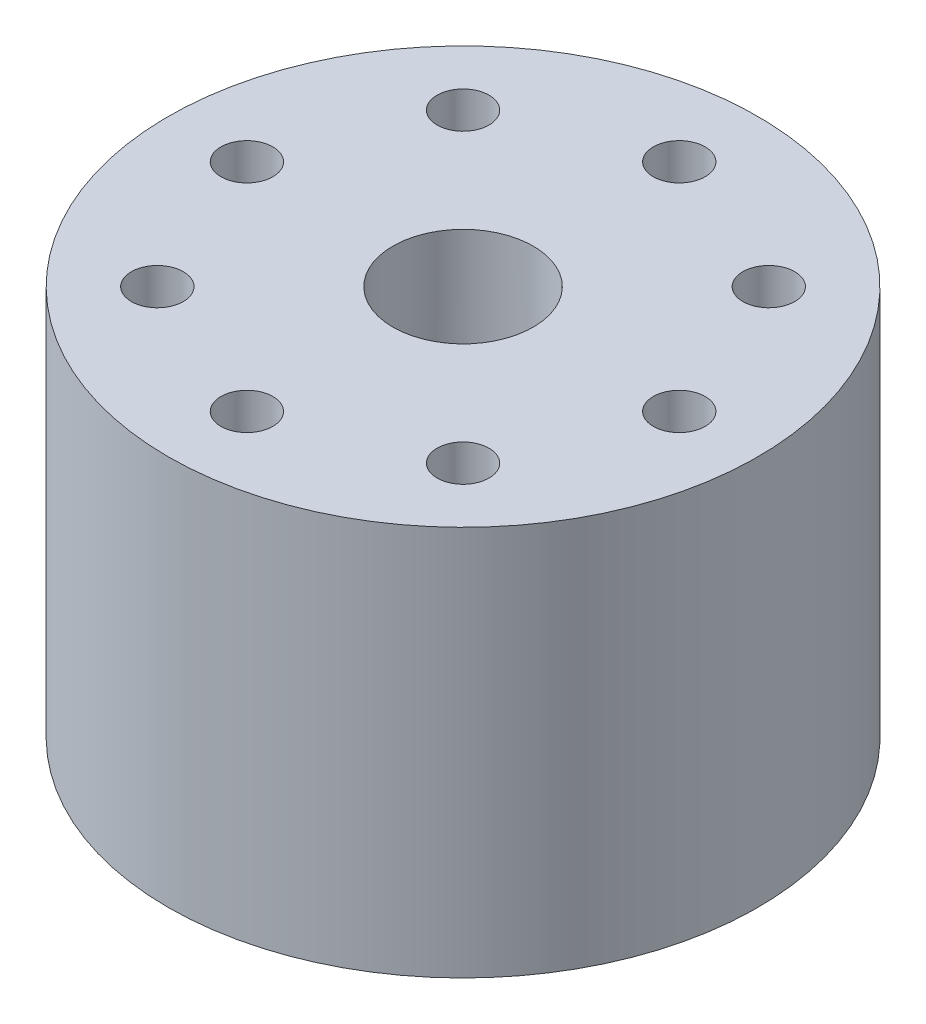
ISO-10303-21;
HEADER;
FILE_DESCRIPTION(('STEP AP214'),'2;1');
FILE_NAME('part.step','',(''),(''),'','','');
FILE_SCHEMA(('AUTOMOTIVE_DESIGN { 1 0 10303 214 1 1 1 1 }'));
ENDSEC;
DATA;
#1=APPLICATION_CONTEXT('core data for automotive mechanical design processes');
#2=APPLICATION_PROTOCOL_DEFINITION('international standard','automotive_design',2000,#1);
#3=PRODUCT_CONTEXT('',#1,'mechanical');
#4=PRODUCT('Part','Part','',(#3));
#5=PRODUCT_RELATED_PRODUCT_CATEGORY('part','',(#4));
#6=PRODUCT_DEFINITION_FORMATION('','',#4);
#7=PRODUCT_DEFINITION_CONTEXT('part definition',#1,'design');
#8=PRODUCT_DEFINITION('design','',#6,#7);
#9=PRODUCT_DEFINITION_SHAPE('','',#8);
#10=(LENGTH_UNIT() NAMED_UNIT(*) SI_UNIT(.MILLI.,.METRE.));
#11=(NAMED_UNIT(*) PLANE_ANGLE_UNIT() SI_UNIT($,.RADIAN.));
#12=(NAMED_UNIT(*) SI_UNIT($,.STERADIAN.) SOLID_ANGLE_UNIT());
#13=UNCERTAINTY_MEASURE_WITH_UNIT(LENGTH_MEASURE(1.E-05),#10,'distance_accuracy_value','');
#14=(GEOMETRIC_REPRESENTATION_CONTEXT(3) GLOBAL_UNCERTAINTY_ASSIGNED_CONTEXT((#13)) GLOBAL_UNIT_ASSIGNED_CONTEXT((#10,
#11,#12)) REPRESENTATION_CONTEXT('',''));
#15=CARTESIAN_POINT('',(0.,0.,0.));
#16=DIRECTION('',(0.,0.,1.));
#17=DIRECTION('',(1.,0.,0.));
#18=AXIS2_PLACEMENT_3D('',#15,#16,#17);
#19=CARTESIAN_POINT('',(0.,49.65,0.));
#20=DIRECTION('',(0.,-1.,0.));
#21=DIRECTION('',(0.,0.,-1.));
#22=AXIS2_PLACEMENT_3D('',#19,#20,#21);
#23=CYLINDRICAL_SURFACE('',#22,37.5);
#24=CARTESIAN_POINT('',(0.,49.65,0.));
#25=DIRECTION('',(0.,1.,0.));
#26=DIRECTION('',(0.,0.,1.));
#27=AXIS2_PLACEMENT_3D('',#24,#25,#26);
#28=CIRCLE('',#27,37.5);
#29=CARTESIAN_POINT('',(0.,49.65,37.5));
#30=VERTEX_POINT('',#29);
#31=EDGE_CURVE('E54',#30,#30,#28,.T.);
#32=ORIENTED_EDGE('',*,*,#31,.F.);
#33=EDGE_LOOP('',(#32));
#34=FACE_BOUND('',#33,.T.);
#35=CARTESIAN_POINT('',(0.,0.,0.));
#36=DIRECTION('',(0.,1.,0.));
#37=DIRECTION('',(0.,0.,1.));
#38=AXIS2_PLACEMENT_3D('',#35,#36,#37);
#39=CIRCLE('',#38,37.5);
#40=CARTESIAN_POINT('',(0.,0.,37.5));
#41=VERTEX_POINT('',#40);
#42=EDGE_CURVE('E58',#41,#41,#39,.T.);
#43=ORIENTED_EDGE('',*,*,#42,.T.);
#44=EDGE_LOOP('',(#43));
#45=FACE_BOUND('',#44,.T.);
#46=ADVANCED_FACE('F43',(#34,#45),#23,.T.);
#47=CARTESIAN_POINT('',(0.,49.65,0.));
#48=DIRECTION('',(0.,1.,0.));
#49=DIRECTION('',(0.,0.,1.));
#50=AXIS2_PLACEMENT_3D('',#47,#48,#49);
#51=PLANE('',#50);
#52=CARTESIAN_POINT('',(0.,49.65,27.5));
#53=DIRECTION('',(0.,1.,0.));
#54=DIRECTION('',(0.,0.,1.));
#55=AXIS2_PLACEMENT_3D('',#52,#53,#54);
#56=CIRCLE('',#55,3.3);
#57=CARTESIAN_POINT('',(0.,49.65,30.8));
#58=VERTEX_POINT('',#57);
#59=EDGE_CURVE('E273',#58,#58,#56,.T.);
#60=ORIENTED_EDGE('',*,*,#59,.F.);
#61=EDGE_LOOP('',(#60));
#62=FACE_BOUND('',#61,.T.);
#63=CARTESIAN_POINT('',(-19.4454364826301,49.65,19.44543648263));
#64=DIRECTION('',(0.,1.,0.));
#65=DIRECTION('',(0.,0.,1.));
#66=AXIS2_PLACEMENT_3D('',#63,#64,#65);
#67=CIRCLE('',#66,3.3);
#68=CARTESIAN_POINT('',(-19.4454364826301,49.65,22.74543648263));
#69=VERTEX_POINT('',#68);
#70=EDGE_CURVE('E279',#69,#69,#67,.T.);
#71=ORIENTED_EDGE('',*,*,#70,.F.);
#72=EDGE_LOOP('',(#71));
#73=FACE_BOUND('',#72,.T.);
#74=CARTESIAN_POINT('',(-27.5,49.65,0.));
#75=DIRECTION('',(0.,1.,0.));
#76=DIRECTION('',(0.,0.,1.));
#77=AXIS2_PLACEMENT_3D('',#74,#75,#76);
#78=CIRCLE('',#77,3.3);
#79=CARTESIAN_POINT('',(-27.5,49.65,3.2999999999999));
#80=VERTEX_POINT('',#79);
#81=EDGE_CURVE('E290',#80,#80,#78,.T.);
#82=ORIENTED_EDGE('',*,*,#81,.F.);
#83=EDGE_LOOP('',(#82));
#84=FACE_BOUND('',#83,.T.);
#85=CARTESIAN_POINT('',(-19.44543648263,49.65,-19.4454364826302));
#86=DIRECTION('',(0.,1.,0.));
#87=DIRECTION('',(0.,0.,1.));
#88=AXIS2_PLACEMENT_3D('',#85,#86,#87);
#89=CIRCLE('',#88,3.3);
#90=CARTESIAN_POINT('',(-19.44543648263,49.65,-16.1454364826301));
#91=VERTEX_POINT('',#90);
#92=EDGE_CURVE('E296',#91,#91,#89,.T.);
#93=ORIENTED_EDGE('',*,*,#92,.F.);
#94=EDGE_LOOP('',(#93));
#95=FACE_BOUND('',#94,.T.);
#96=CARTESIAN_POINT('',(1.92031473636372E-13,49.65,-27.5));
#97=DIRECTION('',(0.,1.,0.));
#98=DIRECTION('',(0.,0.,1.));
#99=AXIS2_PLACEMENT_3D('',#96,#97,#98);
#100=CIRCLE('',#99,3.3);
#101=CARTESIAN_POINT('',(1.92031473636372E-13,49.65,-24.2));
#102=VERTEX_POINT('',#101);
#103=EDGE_CURVE('E302',#102,#102,#100,.T.);
#104=ORIENTED_EDGE('',*,*,#103,.F.);
#105=EDGE_LOOP('',(#104));
#106=FACE_BOUND('',#105,.T.);
#107=CARTESIAN_POINT('',(19.4454364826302,49.65,-19.4454364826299));
#108=DIRECTION('',(0.,1.,0.));
#109=DIRECTION('',(0.,0.,1.));
#110=AXIS2_PLACEMENT_3D('',#107,#108,#109);
#111=CIRCLE('',#110,3.3);
#112=CARTESIAN_POINT('',(19.4454364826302,49.65,-16.1454364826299));
#113=VERTEX_POINT('',#112);
#114=EDGE_CURVE('E331',#113,#113,#111,.T.);
#115=ORIENTED_EDGE('',*,*,#114,.F.);
#116=EDGE_LOOP('',(#115));
#117=FACE_BOUND('',#116,.T.);
#118=CARTESIAN_POINT('',(27.5,49.65,2.88047210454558E-13));
#119=DIRECTION('',(0.,1.,0.));
#120=DIRECTION('',(0.,0.,1.));
#121=AXIS2_PLACEMENT_3D('',#118,#119,#120);
#122=CIRCLE('',#121,3.3);
#123=CARTESIAN_POINT('',(27.5,49.65,3.30000000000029));
#124=VERTEX_POINT('',#123);
#125=EDGE_CURVE('E338',#124,#124,#122,.T.);
#126=ORIENTED_EDGE('',*,*,#125,.F.);
#127=EDGE_LOOP('',(#126));
#128=FACE_BOUND('',#127,.T.);
#129=CARTESIAN_POINT('',(19.4454364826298,49.65,19.4454364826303));
#130=DIRECTION('',(0.,1.,0.));
#131=DIRECTION('',(0.,0.,1.));
#132=AXIS2_PLACEMENT_3D('',#129,#130,#131);
#133=CIRCLE('',#132,3.3);
#134=CARTESIAN_POINT('',(19.4454364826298,49.65,22.7454364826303));
#135=VERTEX_POINT('',#134);
#136=EDGE_CURVE('E274',#135,#135,#133,.T.);
#137=ORIENTED_EDGE('',*,*,#136,.F.);
#138=EDGE_LOOP('',(#137));
#139=FACE_BOUND('',#138,.T.);
#140=CARTESIAN_POINT('',(0.,49.65,0.));
#141=DIRECTION('',(0.,1.,0.));
#142=DIRECTION('',(0.,0.,1.));
#143=AXIS2_PLACEMENT_3D('',#140,#141,#142);
#144=CIRCLE('',#143,8.93);
#145=CARTESIAN_POINT('',(0.,49.65,8.93));
#146=VERTEX_POINT('',#145);
#147=EDGE_CURVE('E62',#146,#146,#144,.T.);
#148=ORIENTED_EDGE('',*,*,#147,.F.);
#149=EDGE_LOOP('',(#148));
#150=FACE_BOUND('',#149,.T.);
#151=ORIENTED_EDGE('',*,*,#31,.T.);
#152=EDGE_LOOP('',(#151));
#153=FACE_BOUND('',#152,.T.);
#154=ADVANCED_FACE('F104',(#62,#73,#84,#95,#106,#117,#128,#139,#150,#153),#51,.T.);
#155=CARTESIAN_POINT('',(0.,0.,0.));
#156=DIRECTION('',(0.,1.,0.));
#157=DIRECTION('',(0.,0.,1.));
#158=AXIS2_PLACEMENT_3D('',#155,#156,#157);
#159=PLANE('',#158);
#160=CARTESIAN_POINT('',(0.,0.,27.5));
#161=DIRECTION('',(0.,1.,0.));
#162=DIRECTION('',(0.,0.,1.));
#163=AXIS2_PLACEMENT_3D('',#160,#161,#162);
#164=CIRCLE('',#163,3.3);
#165=CARTESIAN_POINT('',(0.,0.,30.8));
#166=VERTEX_POINT('',#165);
#167=EDGE_CURVE('E270',#166,#166,#164,.T.);
#168=ORIENTED_EDGE('',*,*,#167,.T.);
#169=EDGE_LOOP('',(#168));
#170=FACE_BOUND('',#169,.T.);
#171=CARTESIAN_POINT('',(-19.4454364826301,0.,19.44543648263));
#172=DIRECTION('',(0.,1.,0.));
#173=DIRECTION('',(0.,0.,1.));
#174=AXIS2_PLACEMENT_3D('',#171,#172,#173);
#175=CIRCLE('',#174,3.3);
#176=CARTESIAN_POINT('',(-19.4454364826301,0.,22.74543648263));
#177=VERTEX_POINT('',#176);
#178=EDGE_CURVE('E287',#177,#177,#175,.T.);
#179=ORIENTED_EDGE('',*,*,#178,.T.);
#180=EDGE_LOOP('',(#179));
#181=FACE_BOUND('',#180,.T.);
#182=CARTESIAN_POINT('',(-27.5,0.,0.));
#183=DIRECTION('',(0.,1.,0.));
#184=DIRECTION('',(0.,0.,1.));
#185=AXIS2_PLACEMENT_3D('',#182,#183,#184);
#186=CIRCLE('',#185,3.3);
#187=CARTESIAN_POINT('',(-27.5,0.,3.2999999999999));
#188=VERTEX_POINT('',#187);
#189=EDGE_CURVE('E293',#188,#188,#186,.T.);
#190=ORIENTED_EDGE('',*,*,#189,.T.);
#191=EDGE_LOOP('',(#190));
#192=FACE_BOUND('',#191,.T.);
#193=CARTESIAN_POINT('',(-19.44543648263,0.,-19.4454364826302));
#194=DIRECTION('',(0.,1.,0.));
#195=DIRECTION('',(0.,0.,1.));
#196=AXIS2_PLACEMENT_3D('',#193,#194,#195);
#197=CIRCLE('',#196,3.3);
#198=CARTESIAN_POINT('',(-19.44543648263,0.,-16.1454364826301));
#199=VERTEX_POINT('',#198);
#200=EDGE_CURVE('E299',#199,#199,#197,.T.);
#201=ORIENTED_EDGE('',*,*,#200,.T.);
#202=EDGE_LOOP('',(#201));
#203=FACE_BOUND('',#202,.T.);
#204=CARTESIAN_POINT('',(1.92031473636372E-13,0.,-27.5));
#205=DIRECTION('',(0.,1.,0.));
#206=DIRECTION('',(0.,0.,1.));
#207=AXIS2_PLACEMENT_3D('',#204,#205,#206);
#208=CIRCLE('',#207,3.3);
#209=CARTESIAN_POINT('',(1.92031473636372E-13,0.,-24.2));
#210=VERTEX_POINT('',#209);
#211=EDGE_CURVE('E326',#210,#210,#208,.T.);
#212=ORIENTED_EDGE('',*,*,#211,.T.);
#213=EDGE_LOOP('',(#212));
#214=FACE_BOUND('',#213,.T.);
#215=CARTESIAN_POINT('',(19.4454364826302,0.,-19.4454364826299));
#216=DIRECTION('',(0.,1.,0.));
#217=DIRECTION('',(0.,0.,1.));
#218=AXIS2_PLACEMENT_3D('',#215,#216,#217);
#219=CIRCLE('',#218,3.3);
#220=CARTESIAN_POINT('',(19.4454364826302,0.,-16.1454364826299));
#221=VERTEX_POINT('',#220);
#222=EDGE_CURVE('E336',#221,#221,#219,.T.);
#223=ORIENTED_EDGE('',*,*,#222,.T.);
#224=EDGE_LOOP('',(#223));
#225=FACE_BOUND('',#224,.T.);
#226=CARTESIAN_POINT('',(27.5,0.,2.88047210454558E-13));
#227=DIRECTION('',(0.,1.,0.));
#228=DIRECTION('',(0.,0.,1.));
#229=AXIS2_PLACEMENT_3D('',#226,#227,#228);
#230=CIRCLE('',#229,3.3);
#231=CARTESIAN_POINT('',(27.5,0.,3.30000000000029));
#232=VERTEX_POINT('',#231);
#233=EDGE_CURVE('E282',#232,#232,#230,.T.);
#234=ORIENTED_EDGE('',*,*,#233,.T.);
#235=EDGE_LOOP('',(#234));
#236=FACE_BOUND('',#235,.T.);
#237=CARTESIAN_POINT('',(19.4454364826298,0.,19.4454364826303));
#238=DIRECTION('',(0.,1.,0.));
#239=DIRECTION('',(0.,0.,1.));
#240=AXIS2_PLACEMENT_3D('',#237,#238,#239);
#241=CIRCLE('',#240,3.3);
#242=CARTESIAN_POINT('',(19.4454364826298,0.,22.7454364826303));
#243=VERTEX_POINT('',#242);
#244=EDGE_CURVE('E277',#243,#243,#241,.T.);
#245=ORIENTED_EDGE('',*,*,#244,.T.);
#246=EDGE_LOOP('',(#245));
#247=FACE_BOUND('',#246,.T.);
#248=CARTESIAN_POINT('',(0.,0.,0.));
#249=DIRECTION('',(0.,-1.,0.));
#250=DIRECTION('',(0.,0.,-1.));
#251=AXIS2_PLACEMENT_3D('',#248,#249,#250);
#252=CIRCLE('',#251,17.);
#253=CARTESIAN_POINT('',(0.,0.,-17.));
#254=VERTEX_POINT('',#253);
#255=EDGE_CURVE('E67',#254,#254,#252,.T.);
#256=ORIENTED_EDGE('',*,*,#255,.F.);
#257=EDGE_LOOP('',(#256));
#258=FACE_BOUND('',#257,.T.);
#259=ORIENTED_EDGE('',*,*,#42,.F.);
#260=EDGE_LOOP('',(#259));
#261=FACE_BOUND('',#260,.T.);
#262=ADVANCED_FACE('F103',(#170,#181,#192,#203,#214,#225,#236,#247,#258,#261),#159,.F.);
#263=CARTESIAN_POINT('',(0.,26.65,0.));
#264=DIRECTION('',(0.,1.,0.));
#265=DIRECTION('',(0.,0.,1.));
#266=AXIS2_PLACEMENT_3D('',#263,#264,#265);
#267=CYLINDRICAL_SURFACE('',#266,8.93);
#268=CARTESIAN_POINT('',(0.,31.4170143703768,0.));
#269=DIRECTION('',(0.,1.,0.));
#270=DIRECTION('',(0.,0.,1.));
#271=AXIS2_PLACEMENT_3D('',#268,#269,#270);
#272=CIRCLE('',#271,8.93);
#273=CARTESIAN_POINT('',(0.,31.4170143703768,8.93));
#274=VERTEX_POINT('',#273);
#275=EDGE_CURVE('E11',#274,#274,#272,.F.);
#276=ORIENTED_EDGE('',*,*,#275,.T.);
#277=EDGE_LOOP('',(#276));
#278=FACE_BOUND('',#277,.T.);
#279=ORIENTED_EDGE('',*,*,#147,.T.);
#280=EDGE_LOOP('',(#279));
#281=FACE_BOUND('',#280,.T.);
#282=ADVANCED_FACE('F96',(#278,#281),#267,.F.);
#283=CARTESIAN_POINT('',(0.,3.15,0.));
#284=DIRECTION('',(0.,-1.,0.));
#285=DIRECTION('',(0.,0.,-1.));
#286=AXIS2_PLACEMENT_3D('',#283,#284,#285);
#287=PLANE('',#286);
#288=CARTESIAN_POINT('',(0.,3.15,0.));
#289=DIRECTION('',(0.,-1.,0.));
#290=DIRECTION('',(0.,0.,-1.));
#291=AXIS2_PLACEMENT_3D('',#288,#289,#290);
#292=CIRCLE('',#291,17.);
#293=CARTESIAN_POINT('',(0.,3.15,-17.));
#294=VERTEX_POINT('',#293);
#295=EDGE_CURVE('E66',#294,#294,#292,.T.);
#296=ORIENTED_EDGE('',*,*,#295,.T.);
#297=EDGE_LOOP('',(#296));
#298=FACE_BOUND('',#297,.T.);
#299=CARTESIAN_POINT('',(0.,3.15,0.));
#300=DIRECTION('',(0.,-1.,0.));
#301=DIRECTION('',(0.,0.,-1.));
#302=AXIS2_PLACEMENT_3D('',#299,#300,#301);
#303=CIRCLE('',#302,13.);
#304=CARTESIAN_POINT('',(0.,3.15,-13.));
#305=VERTEX_POINT('',#304);
#306=EDGE_CURVE('E70',#305,#305,#303,.T.);
#307=ORIENTED_EDGE('',*,*,#306,.F.);
#308=EDGE_LOOP('',(#307));
#309=FACE_BOUND('',#308,.T.);
#310=ADVANCED_FACE('F93',(#298,#309),#287,.T.);
#311=CARTESIAN_POINT('',(0.,3.15,0.));
#312=DIRECTION('',(0.,-1.,0.));
#313=DIRECTION('',(0.,0.,-1.));
#314=AXIS2_PLACEMENT_3D('',#311,#312,#313);
#315=CYLINDRICAL_SURFACE('',#314,17.);
#316=ORIENTED_EDGE('',*,*,#295,.F.);
#317=EDGE_LOOP('',(#316));
#318=FACE_BOUND('',#317,.T.);
#319=ORIENTED_EDGE('',*,*,#255,.T.);
#320=EDGE_LOOP('',(#319));
#321=FACE_BOUND('',#320,.T.);
#322=ADVANCED_FACE('F90',(#318,#321),#315,.F.);
#323=CARTESIAN_POINT('',(-13.,21.61,0.));
#324=CARTESIAN_POINT('',(-20.8,12.38,0.));
#325=CARTESIAN_POINT('',(-13.,3.15,0.));
#326=B_SPLINE_CURVE_WITH_KNOTS('',2,(#323,#324,#325),.UNSPECIFIED.,.F.,.F.,(3,3),(0.,1.),.UNSPECIFIED.);
#327=CARTESIAN_POINT('',(0.,3.15,0.));
#328=DIRECTION('',(0.,-1.,0.));
#329=AXIS1_PLACEMENT('',#327,#328);
#330=SURFACE_OF_REVOLUTION('',#326,#329);
#331=ORIENTED_EDGE('',*,*,#306,.T.);
#332=EDGE_LOOP('',(#331));
#333=FACE_BOUND('',#332,.T.);
#334=CARTESIAN_POINT('',(0.,21.61,0.));
#335=DIRECTION('',(0.,1.,0.));
#336=DIRECTION('',(-1.,0.,0.));
#337=AXIS2_PLACEMENT_3D('',#334,#335,#336);
#338=CIRCLE('',#337,13.);
#339=CARTESIAN_POINT('',(-13.,21.61,0.));
#340=VERTEX_POINT('',#339);
#341=EDGE_CURVE('E75',#340,#340,#338,.T.);
#342=ORIENTED_EDGE('',*,*,#341,.T.);
#343=EDGE_LOOP('',(#342));
#344=FACE_BOUND('',#343,.T.);
#345=ADVANCED_FACE('F85',(#333,#344),#330,.F.);
#346=CARTESIAN_POINT('',(-13.,26.65,0.));
#347=DIRECTION('',(0.,1.,0.));
#348=DIRECTION('',(-1.,0.,0.));
#349=AXIS2_PLACEMENT_3D('',#346,#347,#348);
#350=PLANE('',#349);
#351=CARTESIAN_POINT('',(0.,26.65,0.));
#352=DIRECTION('',(0.,1.,0.));
#353=DIRECTION('',(-1.,0.,0.));
#354=AXIS2_PLACEMENT_3D('',#351,#352,#353);
#355=CIRCLE('',#354,12.93);
#356=CARTESIAN_POINT('',(-12.93,26.65,0.));
#357=VERTEX_POINT('',#356);
#358=EDGE_CURVE('E50',#357,#357,#355,.T.);
#359=ORIENTED_EDGE('',*,*,#358,.T.);
#360=EDGE_LOOP('',(#359));
#361=FACE_BOUND('',#360,.T.);
#362=CARTESIAN_POINT('',(0.,26.65,0.));
#363=DIRECTION('',(0.,1.,0.));
#364=DIRECTION('',(-1.,0.,0.));
#365=AXIS2_PLACEMENT_3D('',#362,#363,#364);
#366=CIRCLE('',#365,13.);
#367=CARTESIAN_POINT('',(-13.,26.65,0.));
#368=VERTEX_POINT('',#367);
#369=EDGE_CURVE('E304',#368,#368,#366,.T.);
#370=ORIENTED_EDGE('',*,*,#369,.F.);
#371=EDGE_LOOP('',(#370));
#372=FACE_BOUND('',#371,.T.);
#373=ADVANCED_FACE('F89',(#361,#372),#350,.F.);
#374=CARTESIAN_POINT('',(0.,26.65,0.));
#375=DIRECTION('',(0.,1.,0.));
#376=DIRECTION('',(-1.,0.,0.));
#377=AXIS2_PLACEMENT_3D('',#374,#375,#376);
#378=CYLINDRICAL_SURFACE('',#377,13.);
#379=ORIENTED_EDGE('',*,*,#341,.F.);
#380=EDGE_LOOP('',(#379));
#381=FACE_BOUND('',#380,.T.);
#382=ORIENTED_EDGE('',*,*,#369,.T.);
#383=EDGE_LOOP('',(#382));
#384=FACE_BOUND('',#383,.T.);
#385=ADVANCED_FACE('F152',(#381,#384),#378,.F.);
#386=CARTESIAN_POINT('',(19.4454364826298,0.,19.4454364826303));
#387=DIRECTION('',(0.,1.,0.));
#388=DIRECTION('',(0.,0.,1.));
#389=AXIS2_PLACEMENT_3D('',#386,#387,#388);
#390=CYLINDRICAL_SURFACE('',#389,3.3);
#391=ORIENTED_EDGE('',*,*,#244,.F.);
#392=EDGE_LOOP('',(#391));
#393=FACE_BOUND('',#392,.T.);
#394=ORIENTED_EDGE('',*,*,#136,.T.);
#395=EDGE_LOOP('',(#394));
#396=FACE_BOUND('',#395,.T.);
#397=ADVANCED_FACE('F158',(#393,#396),#390,.F.);
#398=CARTESIAN_POINT('',(27.5,0.,2.88047210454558E-13));
#399=DIRECTION('',(0.,1.,0.));
#400=DIRECTION('',(0.,0.,1.));
#401=AXIS2_PLACEMENT_3D('',#398,#399,#400);
#402=CYLINDRICAL_SURFACE('',#401,3.3);
#403=ORIENTED_EDGE('',*,*,#125,.T.);
#404=EDGE_LOOP('',(#403));
#405=FACE_BOUND('',#404,.T.);
#406=ORIENTED_EDGE('',*,*,#233,.F.);
#407=EDGE_LOOP('',(#406));
#408=FACE_BOUND('',#407,.T.);
#409=ADVANCED_FACE('F164',(#405,#408),#402,.F.);
#410=CARTESIAN_POINT('',(19.4454364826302,0.,-19.4454364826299));
#411=DIRECTION('',(0.,1.,0.));
#412=DIRECTION('',(0.,0.,1.));
#413=AXIS2_PLACEMENT_3D('',#410,#411,#412);
#414=CYLINDRICAL_SURFACE('',#413,3.3);
#415=ORIENTED_EDGE('',*,*,#222,.F.);
#416=EDGE_LOOP('',(#415));
#417=FACE_BOUND('',#416,.T.);
#418=ORIENTED_EDGE('',*,*,#114,.T.);
#419=EDGE_LOOP('',(#418));
#420=FACE_BOUND('',#419,.T.);
#421=ADVANCED_FACE('F172',(#417,#420),#414,.F.);
#422=CARTESIAN_POINT('',(1.92031473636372E-13,0.,-27.5));
#423=DIRECTION('',(0.,1.,0.));
#424=DIRECTION('',(0.,0.,1.));
#425=AXIS2_PLACEMENT_3D('',#422,#423,#424);
#426=CYLINDRICAL_SURFACE('',#425,3.3);
#427=ORIENTED_EDGE('',*,*,#211,.F.);
#428=EDGE_LOOP('',(#427));
#429=FACE_BOUND('',#428,.T.);
#430=ORIENTED_EDGE('',*,*,#103,.T.);
#431=EDGE_LOOP('',(#430));
#432=FACE_BOUND('',#431,.T.);
#433=ADVANCED_FACE('F180',(#429,#432),#426,.F.);
#434=CARTESIAN_POINT('',(-19.44543648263,0.,-19.4454364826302));
#435=DIRECTION('',(0.,1.,0.));
#436=DIRECTION('',(0.,0.,1.));
#437=AXIS2_PLACEMENT_3D('',#434,#435,#436);
#438=CYLINDRICAL_SURFACE('',#437,3.3);
#439=ORIENTED_EDGE('',*,*,#200,.F.);
#440=EDGE_LOOP('',(#439));
#441=FACE_BOUND('',#440,.T.);
#442=ORIENTED_EDGE('',*,*,#92,.T.);
#443=EDGE_LOOP('',(#442));
#444=FACE_BOUND('',#443,.T.);
#445=ADVANCED_FACE('F188',(#441,#444),#438,.F.);
#446=CARTESIAN_POINT('',(-27.5,0.,0.));
#447=DIRECTION('',(0.,1.,0.));
#448=DIRECTION('',(0.,0.,1.));
#449=AXIS2_PLACEMENT_3D('',#446,#447,#448);
#450=CYLINDRICAL_SURFACE('',#449,3.3);
#451=ORIENTED_EDGE('',*,*,#189,.F.);
#452=EDGE_LOOP('',(#451));
#453=FACE_BOUND('',#452,.T.);
#454=ORIENTED_EDGE('',*,*,#81,.T.);
#455=EDGE_LOOP('',(#454));
#456=FACE_BOUND('',#455,.T.);
#457=ADVANCED_FACE('F196',(#453,#456),#450,.F.);
#458=CARTESIAN_POINT('',(-19.4454364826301,0.,19.44543648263));
#459=DIRECTION('',(0.,1.,0.));
#460=DIRECTION('',(0.,0.,1.));
#461=AXIS2_PLACEMENT_3D('',#458,#459,#460);
#462=CYLINDRICAL_SURFACE('',#461,3.3);
#463=ORIENTED_EDGE('',*,*,#178,.F.);
#464=EDGE_LOOP('',(#463));
#465=FACE_BOUND('',#464,.T.);
#466=ORIENTED_EDGE('',*,*,#70,.T.);
#467=EDGE_LOOP('',(#466));
#468=FACE_BOUND('',#467,.T.);
#469=ADVANCED_FACE('F204',(#465,#468),#462,.F.);
#470=CARTESIAN_POINT('',(0.,0.,27.5));
#471=DIRECTION('',(0.,1.,0.));
#472=DIRECTION('',(0.,0.,1.));
#473=AXIS2_PLACEMENT_3D('',#470,#471,#472);
#474=CYLINDRICAL_SURFACE('',#473,3.3);
#475=ORIENTED_EDGE('',*,*,#167,.F.);
#476=EDGE_LOOP('',(#475));
#477=FACE_BOUND('',#476,.T.);
#478=ORIENTED_EDGE('',*,*,#59,.T.);
#479=EDGE_LOOP('',(#478));
#480=FACE_BOUND('',#479,.T.);
#481=ADVANCED_FACE('F212',(#477,#480),#474,.F.);
#482=CARTESIAN_POINT('',(0.,26.65,0.));
#483=DIRECTION('',(0.,-1.,0.));
#484=DIRECTION('',(0.,0.,-1.));
#485=AXIS2_PLACEMENT_3D('',#482,#483,#484);
#486=CONICAL_SURFACE('',#485,12.93,0.698131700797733);
#487=ORIENTED_EDGE('',*,*,#275,.F.);
#488=EDGE_LOOP('',(#487));
#489=FACE_BOUND('',#488,.T.);
#490=ORIENTED_EDGE('',*,*,#358,.F.);
#491=EDGE_LOOP('',(#490));
#492=FACE_BOUND('',#491,.T.);
#493=ADVANCED_FACE('F45',(#489,#492),#486,.F.);
#494=CLOSED_SHELL('',(#46,#154,#262,#282,#310,#322,#345,#373,#385,#397,#409,#421,#433,#445,#457,
#469,#481,#493));
#495=MANIFOLD_SOLID_BREP('B2',#494);
#496=ADVANCED_BREP_SHAPE_REPRESENTATION('',(#18,#495),#14);
#497=SHAPE_DEFINITION_REPRESENTATION(#9,#496);
ENDSEC;
END-ISO-10303-21;
